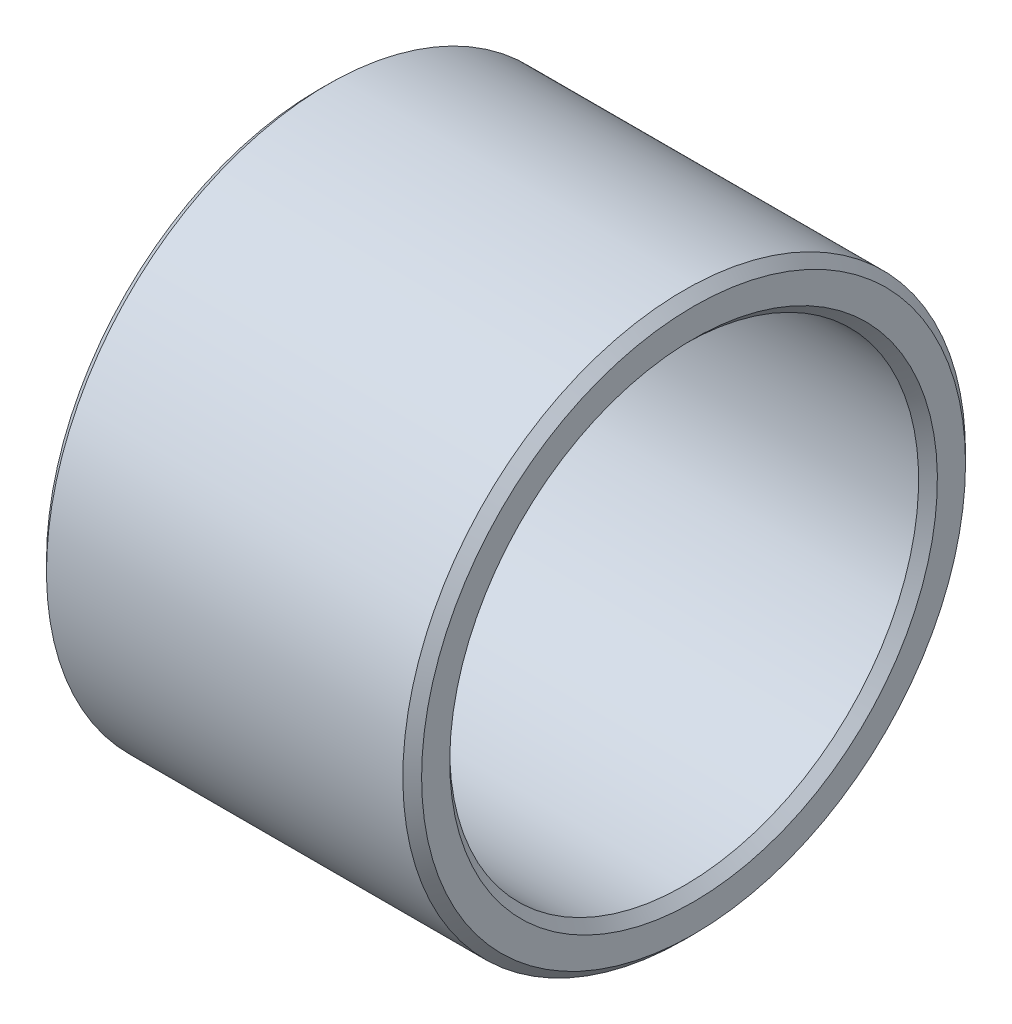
ISO-10303-21;
HEADER;
FILE_DESCRIPTION(('STEP AP214'),'2;1');
FILE_NAME('part.step','',(''),(''),'','','');
FILE_SCHEMA(('AUTOMOTIVE_DESIGN { 1 0 10303 214 1 1 1 1 }'));
ENDSEC;
DATA;
#1=APPLICATION_CONTEXT('core data for automotive mechanical design processes');
#2=APPLICATION_PROTOCOL_DEFINITION('international standard','automotive_design',2000,#1);
#3=PRODUCT_CONTEXT('',#1,'mechanical');
#4=PRODUCT('Part','Part','',(#3));
#5=PRODUCT_RELATED_PRODUCT_CATEGORY('part','',(#4));
#6=PRODUCT_DEFINITION_FORMATION('','',#4);
#7=PRODUCT_DEFINITION_CONTEXT('part definition',#1,'design');
#8=PRODUCT_DEFINITION('design','',#6,#7);
#9=PRODUCT_DEFINITION_SHAPE('','',#8);
#10=(LENGTH_UNIT() NAMED_UNIT(*) SI_UNIT(.MILLI.,.METRE.));
#11=(NAMED_UNIT(*) PLANE_ANGLE_UNIT() SI_UNIT($,.RADIAN.));
#12=(NAMED_UNIT(*) SI_UNIT($,.STERADIAN.) SOLID_ANGLE_UNIT());
#13=UNCERTAINTY_MEASURE_WITH_UNIT(LENGTH_MEASURE(1.E-05),#10,'distance_accuracy_value','');
#14=(GEOMETRIC_REPRESENTATION_CONTEXT(3) GLOBAL_UNCERTAINTY_ASSIGNED_CONTEXT((#13)) GLOBAL_UNIT_ASSIGNED_CONTEXT((#10,
#11,#12)) REPRESENTATION_CONTEXT('',''));
#15=CARTESIAN_POINT('',(0.,0.,0.));
#16=DIRECTION('',(0.,0.,1.));
#17=DIRECTION('',(1.,0.,0.));
#18=AXIS2_PLACEMENT_3D('',#15,#16,#17);
#19=CARTESIAN_POINT('',(0.,-11.,0.));
#20=DIRECTION('',(-1.,0.,0.));
#21=DIRECTION('',(0.,1.,0.));
#22=AXIS2_PLACEMENT_3D('',#19,#20,#21);
#23=PLANE('',#22);
#24=CARTESIAN_POINT('',(0.,0.,0.));
#25=DIRECTION('',(1.,0.,0.));
#26=DIRECTION('',(0.,-1.,0.));
#27=AXIS2_PLACEMENT_3D('',#24,#25,#26);
#28=CIRCLE('',#27,10.4);
#29=CARTESIAN_POINT('',(0.,-10.4,0.));
#30=VERTEX_POINT('',#29);
#31=EDGE_CURVE('E9',#30,#30,#28,.T.);
#32=ORIENTED_EDGE('',*,*,#31,.T.);
#33=EDGE_LOOP('',(#32));
#34=FACE_BOUND('',#33,.T.);
#35=CARTESIAN_POINT('',(0.,0.,0.));
#36=DIRECTION('',(1.,0.,0.));
#37=DIRECTION('',(0.,-1.,0.));
#38=AXIS2_PLACEMENT_3D('',#35,#36,#37);
#39=CIRCLE('',#38,11.6);
#40=CARTESIAN_POINT('',(0.,-11.6,0.));
#41=VERTEX_POINT('',#40);
#42=EDGE_CURVE('E58',#41,#41,#39,.T.);
#43=ORIENTED_EDGE('',*,*,#42,.F.);
#44=EDGE_LOOP('',(#43));
#45=FACE_BOUND('',#44,.T.);
#46=ADVANCED_FACE('F15',(#34,#45),#23,.T.);
#47=CARTESIAN_POINT('',(0.2,0.,0.));
#48=DIRECTION('',(-1.,0.,0.));
#49=DIRECTION('',(0.,-1.,0.));
#50=AXIS2_PLACEMENT_3D('',#47,#48,#49);
#51=CONICAL_SURFACE('',#50,10.2,0.785398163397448);
#52=CARTESIAN_POINT('',(0.4,0.,0.));
#53=DIRECTION('',(1.,0.,0.));
#54=DIRECTION('',(0.,-1.,0.));
#55=AXIS2_PLACEMENT_3D('',#52,#53,#54);
#56=CIRCLE('',#55,10.);
#57=CARTESIAN_POINT('',(0.4,-10.,0.));
#58=VERTEX_POINT('',#57);
#59=EDGE_CURVE('E25',#58,#58,#56,.T.);
#60=ORIENTED_EDGE('',*,*,#59,.T.);
#61=EDGE_LOOP('',(#60));
#62=FACE_BOUND('',#61,.T.);
#63=ORIENTED_EDGE('',*,*,#31,.F.);
#64=EDGE_LOOP('',(#63));
#65=FACE_BOUND('',#64,.T.);
#66=ADVANCED_FACE('F86',(#62,#65),#51,.F.);
#67=CARTESIAN_POINT('',(8.,0.,0.));
#68=DIRECTION('',(-1.,0.,0.));
#69=DIRECTION('',(0.,-1.,0.));
#70=AXIS2_PLACEMENT_3D('',#67,#68,#69);
#71=CYLINDRICAL_SURFACE('',#70,10.);
#72=CARTESIAN_POINT('',(15.6,0.,0.));
#73=DIRECTION('',(1.,0.,0.));
#74=DIRECTION('',(0.,-1.,0.));
#75=AXIS2_PLACEMENT_3D('',#72,#73,#74);
#76=CIRCLE('',#75,10.);
#77=CARTESIAN_POINT('',(15.6,-10.,0.));
#78=VERTEX_POINT('',#77);
#79=EDGE_CURVE('E63',#78,#78,#76,.T.);
#80=ORIENTED_EDGE('',*,*,#79,.T.);
#81=EDGE_LOOP('',(#80));
#82=FACE_BOUND('',#81,.T.);
#83=ORIENTED_EDGE('',*,*,#59,.F.);
#84=EDGE_LOOP('',(#83));
#85=FACE_BOUND('',#84,.T.);
#86=ADVANCED_FACE('F17',(#82,#85),#71,.F.);
#87=CARTESIAN_POINT('',(15.8,0.,0.));
#88=DIRECTION('',(1.,0.,0.));
#89=DIRECTION('',(0.,-1.,0.));
#90=AXIS2_PLACEMENT_3D('',#87,#88,#89);
#91=CONICAL_SURFACE('',#90,10.2,0.785398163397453);
#92=CARTESIAN_POINT('',(16.,0.,0.));
#93=DIRECTION('',(1.,0.,0.));
#94=DIRECTION('',(0.,-1.,0.));
#95=AXIS2_PLACEMENT_3D('',#92,#93,#94);
#96=CIRCLE('',#95,10.4);
#97=CARTESIAN_POINT('',(16.,-10.4,0.));
#98=VERTEX_POINT('',#97);
#99=EDGE_CURVE('E19',#98,#98,#96,.T.);
#100=ORIENTED_EDGE('',*,*,#99,.T.);
#101=EDGE_LOOP('',(#100));
#102=FACE_BOUND('',#101,.T.);
#103=ORIENTED_EDGE('',*,*,#79,.F.);
#104=EDGE_LOOP('',(#103));
#105=FACE_BOUND('',#104,.T.);
#106=ADVANCED_FACE('F71',(#102,#105),#91,.F.);
#107=CARTESIAN_POINT('',(16.,-11.,0.));
#108=DIRECTION('',(1.,0.,0.));
#109=DIRECTION('',(0.,-1.,0.));
#110=AXIS2_PLACEMENT_3D('',#107,#108,#109);
#111=PLANE('',#110);
#112=CARTESIAN_POINT('',(16.,0.,0.));
#113=DIRECTION('',(1.,0.,0.));
#114=DIRECTION('',(0.,-1.,0.));
#115=AXIS2_PLACEMENT_3D('',#112,#113,#114);
#116=CIRCLE('',#115,11.6);
#117=CARTESIAN_POINT('',(16.,-11.6,0.));
#118=VERTEX_POINT('',#117);
#119=EDGE_CURVE('E40',#118,#118,#116,.T.);
#120=ORIENTED_EDGE('',*,*,#119,.T.);
#121=EDGE_LOOP('',(#120));
#122=FACE_BOUND('',#121,.T.);
#123=ORIENTED_EDGE('',*,*,#99,.F.);
#124=EDGE_LOOP('',(#123));
#125=FACE_BOUND('',#124,.T.);
#126=ADVANCED_FACE('F74',(#122,#125),#111,.T.);
#127=CARTESIAN_POINT('',(15.8,0.,0.));
#128=DIRECTION('',(-1.,0.,0.));
#129=DIRECTION('',(0.,-1.,0.));
#130=AXIS2_PLACEMENT_3D('',#127,#128,#129);
#131=CONICAL_SURFACE('',#130,11.8,0.785398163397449);
#132=CARTESIAN_POINT('',(15.6,0.,0.));
#133=DIRECTION('',(1.,0.,0.));
#134=DIRECTION('',(0.,-1.,0.));
#135=AXIS2_PLACEMENT_3D('',#132,#133,#134);
#136=CIRCLE('',#135,12.);
#137=CARTESIAN_POINT('',(15.6,-12.,0.));
#138=VERTEX_POINT('',#137);
#139=EDGE_CURVE('E47',#138,#138,#136,.T.);
#140=ORIENTED_EDGE('',*,*,#139,.T.);
#141=EDGE_LOOP('',(#140));
#142=FACE_BOUND('',#141,.T.);
#143=ORIENTED_EDGE('',*,*,#119,.F.);
#144=EDGE_LOOP('',(#143));
#145=FACE_BOUND('',#144,.T.);
#146=ADVANCED_FACE('F76',(#142,#145),#131,.T.);
#147=CARTESIAN_POINT('',(8.,0.,0.));
#148=DIRECTION('',(-1.,0.,0.));
#149=DIRECTION('',(0.,-1.,0.));
#150=AXIS2_PLACEMENT_3D('',#147,#148,#149);
#151=CYLINDRICAL_SURFACE('',#150,12.);
#152=CARTESIAN_POINT('',(0.4,0.,0.));
#153=DIRECTION('',(1.,0.,0.));
#154=DIRECTION('',(0.,-1.,0.));
#155=AXIS2_PLACEMENT_3D('',#152,#153,#154);
#156=CIRCLE('',#155,12.);
#157=CARTESIAN_POINT('',(0.4,-12.,0.));
#158=VERTEX_POINT('',#157);
#159=EDGE_CURVE('E54',#158,#158,#156,.T.);
#160=ORIENTED_EDGE('',*,*,#159,.T.);
#161=EDGE_LOOP('',(#160));
#162=FACE_BOUND('',#161,.T.);
#163=ORIENTED_EDGE('',*,*,#139,.F.);
#164=EDGE_LOOP('',(#163));
#165=FACE_BOUND('',#164,.T.);
#166=ADVANCED_FACE('F55',(#162,#165),#151,.T.);
#167=CARTESIAN_POINT('',(0.2,0.,0.));
#168=DIRECTION('',(1.,0.,0.));
#169=DIRECTION('',(0.,-1.,0.));
#170=AXIS2_PLACEMENT_3D('',#167,#168,#169);
#171=CONICAL_SURFACE('',#170,11.8,0.785398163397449);
#172=ORIENTED_EDGE('',*,*,#42,.T.);
#173=EDGE_LOOP('',(#172));
#174=FACE_BOUND('',#173,.T.);
#175=ORIENTED_EDGE('',*,*,#159,.F.);
#176=EDGE_LOOP('',(#175));
#177=FACE_BOUND('',#176,.T.);
#178=ADVANCED_FACE('F95',(#174,#177),#171,.T.);
#179=CLOSED_SHELL('',(#46,#66,#86,#106,#126,#146,#166,#178));
#180=MANIFOLD_SOLID_BREP('B1',#179);
#181=ADVANCED_BREP_SHAPE_REPRESENTATION('',(#18,#180),#14);
#182=SHAPE_DEFINITION_REPRESENTATION(#9,#181);
ENDSEC;
END-ISO-10303-21;
